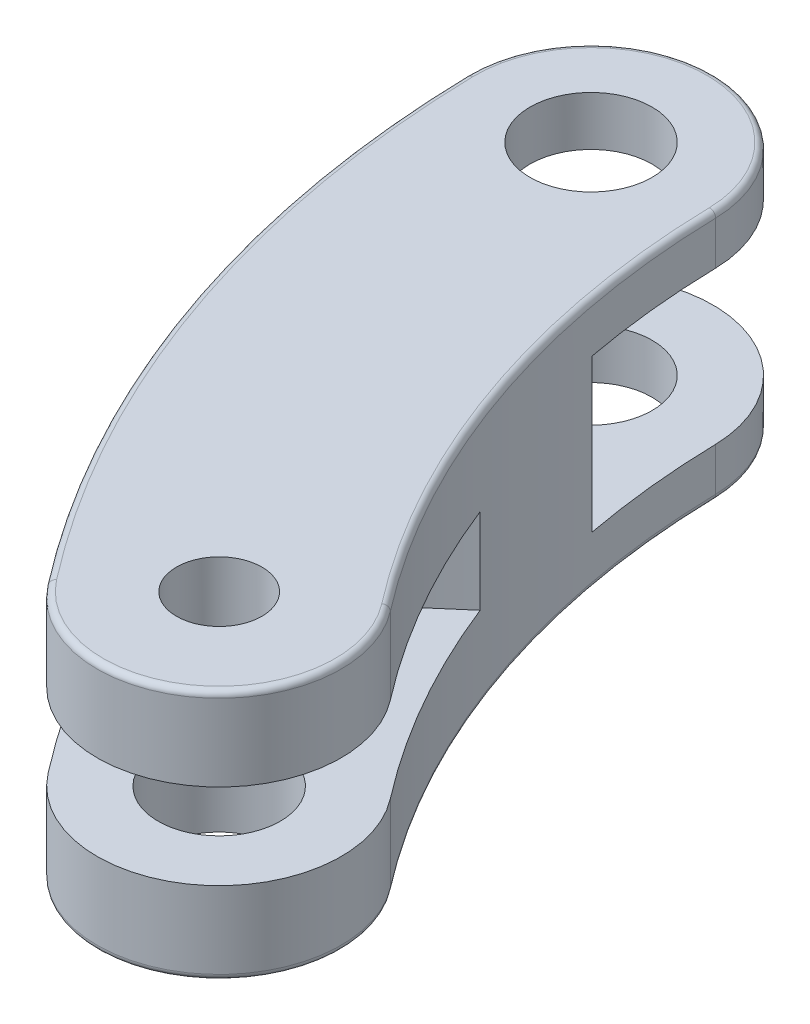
ISO-10303-21;
HEADER;
FILE_DESCRIPTION(('STEP AP214'),'2;1');
FILE_NAME('part.step','',(''),(''),'','','');
FILE_SCHEMA(('AUTOMOTIVE_DESIGN { 1 0 10303 214 1 1 1 1 }'));
ENDSEC;
DATA;
#1=APPLICATION_CONTEXT('core data for automotive mechanical design processes');
#2=APPLICATION_PROTOCOL_DEFINITION('international standard','automotive_design',2000,#1);
#3=PRODUCT_CONTEXT('',#1,'mechanical');
#4=PRODUCT('Part','Part','',(#3));
#5=PRODUCT_RELATED_PRODUCT_CATEGORY('part','',(#4));
#6=PRODUCT_DEFINITION_FORMATION('','',#4);
#7=PRODUCT_DEFINITION_CONTEXT('part definition',#1,'design');
#8=PRODUCT_DEFINITION('design','',#6,#7);
#9=PRODUCT_DEFINITION_SHAPE('','',#8);
#10=(LENGTH_UNIT() NAMED_UNIT(*) SI_UNIT(.MILLI.,.METRE.));
#11=(NAMED_UNIT(*) PLANE_ANGLE_UNIT() SI_UNIT($,.RADIAN.));
#12=(NAMED_UNIT(*) SI_UNIT($,.STERADIAN.) SOLID_ANGLE_UNIT());
#13=UNCERTAINTY_MEASURE_WITH_UNIT(LENGTH_MEASURE(1.E-05),#10,'distance_accuracy_value','');
#14=(GEOMETRIC_REPRESENTATION_CONTEXT(3) GLOBAL_UNCERTAINTY_ASSIGNED_CONTEXT((#13)) GLOBAL_UNIT_ASSIGNED_CONTEXT((#10,
#11,#12)) REPRESENTATION_CONTEXT('',''));
#15=CARTESIAN_POINT('',(0.,0.,0.));
#16=DIRECTION('',(0.,0.,1.));
#17=DIRECTION('',(1.,0.,0.));
#18=AXIS2_PLACEMENT_3D('',#15,#16,#17);
#19=CARTESIAN_POINT('',(2160.44964708,591.734442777,716.131939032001));
#20=DIRECTION('',(0.,1.,0.));
#21=DIRECTION('',(0.,0.,1.));
#22=AXIS2_PLACEMENT_3D('',#19,#20,#21);
#23=CYLINDRICAL_SURFACE('',#22,10.0000000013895);
#24=DIRECTION('',(0.,1.,0.));
#25=VECTOR('',#24,1.);
#26=CARTESIAN_POINT('',(2168.36413867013,591.734442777,710.019589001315));
#27=LINE('',#26,#25);
#28=CARTESIAN_POINT('',(2168.36413867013,605.534442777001,710.019589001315));
#29=VERTEX_POINT('',#28);
#30=CARTESIAN_POINT('',(2168.36413867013,611.833591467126,710.019589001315));
#31=VERTEX_POINT('',#30);
#32=EDGE_CURVE('E196',#29,#31,#27,.T.);
#33=ORIENTED_EDGE('',*,*,#32,.T.);
#34=CARTESIAN_POINT('',(2160.44964708,611.833591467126,716.131939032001));
#35=DIRECTION('',(0.,-1.,0.));
#36=DIRECTION('',(0.,0.,-1.));
#37=AXIS2_PLACEMENT_3D('',#34,#35,#36);
#38=CIRCLE('',#37,10.0000000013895);
#39=CARTESIAN_POINT('',(2152.535155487,611.833591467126,722.244289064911));
#40=VERTEX_POINT('',#39);
#41=EDGE_CURVE('E232',#31,#40,#38,.T.);
#42=ORIENTED_EDGE('',*,*,#41,.T.);
#43=DIRECTION('',(0.,1.,0.));
#44=VECTOR('',#43,1.);
#45=CARTESIAN_POINT('',(2152.535155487,591.734442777,722.244289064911));
#46=LINE('',#45,#44);
#47=CARTESIAN_POINT('',(2152.535155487,605.534442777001,722.244289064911));
#48=VERTEX_POINT('',#47);
#49=EDGE_CURVE('E199',#48,#40,#46,.T.);
#50=ORIENTED_EDGE('',*,*,#49,.F.);
#51=CARTESIAN_POINT('',(2160.44964708,605.534442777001,716.131939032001));
#52=DIRECTION('',(0.,1.,0.));
#53=DIRECTION('',(0.,0.,1.));
#54=AXIS2_PLACEMENT_3D('',#51,#52,#53);
#55=CIRCLE('',#54,10.0000000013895);
#56=EDGE_CURVE('E155',#29,#48,#55,.F.);
#57=ORIENTED_EDGE('',*,*,#56,.F.);
#58=EDGE_LOOP('',(#33,#42,#50,#57));
#59=FACE_BOUND('',#58,.T.);
#60=ADVANCED_FACE('F33',(#59),#23,.T.);
#61=CARTESIAN_POINT('',(2143.78489095,591.734442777,668.990811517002));
#62=DIRECTION('',(0.,1.,0.));
#63=DIRECTION('',(0.,0.,1.));
#64=AXIS2_PLACEMENT_3D('',#61,#62,#63);
#65=CYLINDRICAL_SURFACE('',#64,10.0000000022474);
#66=DIRECTION('',(0.,1.,0.));
#67=VECTOR('',#66,1.);
#68=CARTESIAN_POINT('',(2133.78730484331,591.734442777,669.210520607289));
#69=LINE('',#68,#67);
#70=CARTESIAN_POINT('',(2133.78730484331,608.284442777,669.210520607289));
#71=VERTEX_POINT('',#70);
#72=CARTESIAN_POINT('',(2133.78730484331,611.833591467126,669.210520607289));
#73=VERTEX_POINT('',#72);
#74=EDGE_CURVE('E202',#71,#73,#69,.T.);
#75=ORIENTED_EDGE('',*,*,#74,.T.);
#76=CARTESIAN_POINT('',(2143.78489095,611.833591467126,668.990811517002));
#77=DIRECTION('',(0.,-1.,0.));
#78=DIRECTION('',(0.,0.,-1.));
#79=AXIS2_PLACEMENT_3D('',#76,#77,#78);
#80=CIRCLE('',#79,10.0000000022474);
#81=CARTESIAN_POINT('',(2153.78247705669,611.833591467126,668.771102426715));
#82=VERTEX_POINT('',#81);
#83=EDGE_CURVE('E225',#73,#82,#80,.T.);
#84=ORIENTED_EDGE('',*,*,#83,.T.);
#85=DIRECTION('',(0.,1.,0.));
#86=VECTOR('',#85,1.);
#87=CARTESIAN_POINT('',(2153.78247705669,591.734442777,668.771102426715));
#88=LINE('',#87,#86);
#89=CARTESIAN_POINT('',(2153.78247705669,608.284442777,668.771102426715));
#90=VERTEX_POINT('',#89);
#91=EDGE_CURVE('E192',#90,#82,#88,.T.);
#92=ORIENTED_EDGE('',*,*,#91,.F.);
#93=CARTESIAN_POINT('',(2143.78489095,608.284442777,668.990811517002));
#94=DIRECTION('',(0.,1.,0.));
#95=DIRECTION('',(0.,0.,1.));
#96=AXIS2_PLACEMENT_3D('',#93,#94,#95);
#97=CIRCLE('',#96,10.0000000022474);
#98=EDGE_CURVE('E207',#71,#90,#97,.F.);
#99=ORIENTED_EDGE('',*,*,#98,.F.);
#100=EDGE_LOOP('',(#75,#84,#92,#99));
#101=FACE_BOUND('',#100,.T.);
#102=ADVANCED_FACE('F347',(#101),#65,.T.);
#103=CARTESIAN_POINT('',(2223.76557979,591.734442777,667.233138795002));
#104=DIRECTION('',(0.,1.,0.));
#105=DIRECTION('',(0.,0.,1.));
#106=AXIS2_PLACEMENT_3D('',#103,#104,#105);
#107=CYLINDRICAL_SURFACE('',#106,69.9999999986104);
#108=CARTESIAN_POINT('',(2168.36413867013,592.235398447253,710.019589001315));
#109=VERTEX_POINT('',#108);
#110=CARTESIAN_POINT('',(2168.36413867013,598.534442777,710.019589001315));
#111=VERTEX_POINT('',#110);
#112=EDGE_CURVE('E193',#109,#111,#27,.T.);
#113=ORIENTED_EDGE('',*,*,#112,.F.);
#114=CARTESIAN_POINT('',(2223.76557979,592.235398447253,667.233138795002));
#115=DIRECTION('',(0.,-1.,0.));
#116=DIRECTION('',(0.,0.,-1.));
#117=AXIS2_PLACEMENT_3D('',#114,#115,#116);
#118=CIRCLE('',#117,69.9999999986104);
#119=CARTESIAN_POINT('',(2153.78247705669,592.235398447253,668.771102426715));
#120=VERTEX_POINT('',#119);
#121=EDGE_CURVE('E234',#109,#120,#118,.T.);
#122=ORIENTED_EDGE('',*,*,#121,.T.);
#123=CARTESIAN_POINT('',(2153.78247705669,595.784442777,668.771102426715));
#124=VERTEX_POINT('',#123);
#125=EDGE_CURVE('E203',#120,#124,#88,.T.);
#126=ORIENTED_EDGE('',*,*,#125,.T.);
#127=CARTESIAN_POINT('',(2223.76557979,595.784442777,667.233138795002));
#128=DIRECTION('',(0.,-1.,0.));
#129=DIRECTION('',(0.,0.,-1.));
#130=AXIS2_PLACEMENT_3D('',#127,#128,#129);
#131=CIRCLE('',#130,69.9999999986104);
#132=CARTESIAN_POINT('',(2154.95172259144,595.784442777,680.064859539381));
#133=VERTEX_POINT('',#132);
#134=EDGE_CURVE('E183',#133,#124,#131,.T.);
#135=ORIENTED_EDGE('',*,*,#134,.F.);
#136=DIRECTION('',(0.,1.,0.));
#137=VECTOR('',#136,1.);
#138=CARTESIAN_POINT('',(2154.95172259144,602.034442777,680.064859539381));
#139=LINE('',#138,#137);
#140=CARTESIAN_POINT('',(2154.95172259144,608.284442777,680.064859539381));
#141=VERTEX_POINT('',#140);
#142=EDGE_CURVE('E190',#141,#133,#139,.F.);
#143=ORIENTED_EDGE('',*,*,#142,.F.);
#144=CARTESIAN_POINT('',(2223.76557979,608.284442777,667.233138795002));
#145=DIRECTION('',(0.,1.,0.));
#146=DIRECTION('',(0.,0.,1.));
#147=AXIS2_PLACEMENT_3D('',#144,#145,#146);
#148=CIRCLE('',#147,69.9999999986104);
#149=EDGE_CURVE('E188',#90,#141,#148,.T.);
#150=ORIENTED_EDGE('',*,*,#149,.F.);
#151=ORIENTED_EDGE('',*,*,#91,.T.);
#152=CARTESIAN_POINT('',(2223.76557979,611.833591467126,667.233138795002));
#153=DIRECTION('',(0.,-1.,0.));
#154=DIRECTION('',(0.,0.,-1.));
#155=AXIS2_PLACEMENT_3D('',#152,#153,#154);
#156=CIRCLE('',#155,69.9999999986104);
#157=EDGE_CURVE('E230',#82,#31,#156,.F.);
#158=ORIENTED_EDGE('',*,*,#157,.T.);
#159=ORIENTED_EDGE('',*,*,#32,.F.);
#160=CARTESIAN_POINT('',(2223.76557979,605.534442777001,667.233138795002));
#161=DIRECTION('',(0.,1.,0.));
#162=DIRECTION('',(0.,0.,1.));
#163=AXIS2_PLACEMENT_3D('',#160,#161,#162);
#164=CIRCLE('',#163,69.9999999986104);
#165=CARTESIAN_POINT('',(2158.66503431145,605.534442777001,692.960924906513));
#166=VERTEX_POINT('',#165);
#167=EDGE_CURVE('E170',#166,#29,#164,.T.);
#168=ORIENTED_EDGE('',*,*,#167,.F.);
#169=DIRECTION('',(0.,1.,0.));
#170=VECTOR('',#169,1.);
#171=CARTESIAN_POINT('',(2158.66503431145,602.034442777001,692.960924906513));
#172=LINE('',#171,#170);
#173=CARTESIAN_POINT('',(2158.66503431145,598.534442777,692.960924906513));
#174=VERTEX_POINT('',#173);
#175=EDGE_CURVE('E160',#174,#166,#172,.T.);
#176=ORIENTED_EDGE('',*,*,#175,.F.);
#177=CARTESIAN_POINT('',(2223.76557979,598.534442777,667.233138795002));
#178=DIRECTION('',(0.,-1.,0.));
#179=DIRECTION('',(0.,0.,-1.));
#180=AXIS2_PLACEMENT_3D('',#177,#178,#179);
#181=CIRCLE('',#180,69.9999999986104);
#182=EDGE_CURVE('E144',#111,#174,#181,.T.);
#183=ORIENTED_EDGE('',*,*,#182,.F.);
#184=EDGE_LOOP('',(#113,#122,#126,#135,#143,#150,#151,#158,#159,#168,#176,#183));
#185=FACE_BOUND('',#184,.T.);
#186=ADVANCED_FACE('F35',(#185),#107,.F.);
#187=CARTESIAN_POINT('',(2152.535155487,592.235398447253,722.244289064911));
#188=VERTEX_POINT('',#187);
#189=CARTESIAN_POINT('',(2152.535155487,598.534442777,722.244289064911));
#190=VERTEX_POINT('',#189);
#191=EDGE_CURVE('E197',#188,#190,#46,.T.);
#192=ORIENTED_EDGE('',*,*,#191,.F.);
#193=CARTESIAN_POINT('',(2160.44964708,592.235398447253,716.131939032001));
#194=DIRECTION('',(0.,-1.,0.));
#195=DIRECTION('',(0.,0.,-1.));
#196=AXIS2_PLACEMENT_3D('',#193,#194,#195);
#197=CIRCLE('',#196,10.0000000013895);
#198=EDGE_CURVE('E246',#188,#109,#197,.F.);
#199=ORIENTED_EDGE('',*,*,#198,.T.);
#200=ORIENTED_EDGE('',*,*,#112,.T.);
#201=CARTESIAN_POINT('',(2160.44964708,598.534442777,716.131939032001));
#202=DIRECTION('',(0.,-1.,0.));
#203=DIRECTION('',(0.,0.,-1.));
#204=AXIS2_PLACEMENT_3D('',#201,#202,#203);
#205=CIRCLE('',#204,10.0000000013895);
#206=EDGE_CURVE('E151',#190,#111,#205,.F.);
#207=ORIENTED_EDGE('',*,*,#206,.F.);
#208=EDGE_LOOP('',(#192,#199,#200,#207));
#209=FACE_BOUND('',#208,.T.);
#210=ADVANCED_FACE('F249',(#209),#23,.T.);
#211=CARTESIAN_POINT('',(2223.76557979,591.734442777,667.233138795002));
#212=DIRECTION('',(0.,1.,0.));
#213=DIRECTION('',(0.,0.,1.));
#214=AXIS2_PLACEMENT_3D('',#211,#212,#213);
#215=CYLINDRICAL_SURFACE('',#214,90.0000000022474);
#216=CARTESIAN_POINT('',(2133.78730484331,592.235398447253,669.210520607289));
#217=VERTEX_POINT('',#216);
#218=CARTESIAN_POINT('',(2133.78730484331,595.784442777,669.210520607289));
#219=VERTEX_POINT('',#218);
#220=EDGE_CURVE('E200',#217,#219,#69,.T.);
#221=ORIENTED_EDGE('',*,*,#220,.F.);
#222=CARTESIAN_POINT('',(2223.76557979,592.235398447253,667.233138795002));
#223=DIRECTION('',(0.,-1.,0.));
#224=DIRECTION('',(0.,0.,-1.));
#225=AXIS2_PLACEMENT_3D('',#222,#223,#224);
#226=CIRCLE('',#225,90.0000000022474);
#227=EDGE_CURVE('E11',#217,#188,#226,.F.);
#228=ORIENTED_EDGE('',*,*,#227,.T.);
#229=ORIENTED_EDGE('',*,*,#191,.T.);
#230=CARTESIAN_POINT('',(2223.76557979,598.534442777,667.233138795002));
#231=DIRECTION('',(0.,-1.,0.));
#232=DIRECTION('',(0.,0.,-1.));
#233=AXIS2_PLACEMENT_3D('',#230,#231,#232);
#234=CIRCLE('',#233,90.0000000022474);
#235=CARTESIAN_POINT('',(2143.99607730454,598.534442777,708.90838892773));
#236=VERTEX_POINT('',#235);
#237=EDGE_CURVE('E211',#236,#190,#234,.F.);
#238=ORIENTED_EDGE('',*,*,#237,.F.);
#239=DIRECTION('',(0.,1.,0.));
#240=VECTOR('',#239,1.);
#241=CARTESIAN_POINT('',(2143.99607730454,602.034442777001,708.90838892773));
#242=LINE('',#241,#240);
#243=CARTESIAN_POINT('',(2143.99607730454,605.534442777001,708.908388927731));
#244=VERTEX_POINT('',#243);
#245=EDGE_CURVE('E163',#244,#236,#242,.F.);
#246=ORIENTED_EDGE('',*,*,#245,.F.);
#247=CARTESIAN_POINT('',(2223.76557979,605.534442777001,667.233138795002));
#248=DIRECTION('',(0.,1.,0.));
#249=DIRECTION('',(0.,0.,1.));
#250=AXIS2_PLACEMENT_3D('',#247,#248,#249);
#251=CIRCLE('',#250,90.0000000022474);
#252=EDGE_CURVE('E214',#48,#244,#251,.F.);
#253=ORIENTED_EDGE('',*,*,#252,.F.);
#254=ORIENTED_EDGE('',*,*,#49,.T.);
#255=CARTESIAN_POINT('',(2223.76557979,611.833591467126,667.233138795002));
#256=DIRECTION('',(0.,-1.,0.));
#257=DIRECTION('',(0.,0.,-1.));
#258=AXIS2_PLACEMENT_3D('',#255,#256,#257);
#259=CIRCLE('',#258,90.0000000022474);
#260=EDGE_CURVE('E228',#40,#73,#259,.T.);
#261=ORIENTED_EDGE('',*,*,#260,.T.);
#262=ORIENTED_EDGE('',*,*,#74,.F.);
#263=CARTESIAN_POINT('',(2223.76557979,608.284442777,667.233138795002));
#264=DIRECTION('',(0.,1.,0.));
#265=DIRECTION('',(0.,0.,1.));
#266=AXIS2_PLACEMENT_3D('',#263,#264,#265);
#267=CIRCLE('',#266,90.0000000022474);
#268=CARTESIAN_POINT('',(2135.40094688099,608.284442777,684.31212152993));
#269=VERTEX_POINT('',#268);
#270=EDGE_CURVE('E186',#269,#71,#267,.F.);
#271=ORIENTED_EDGE('',*,*,#270,.F.);
#272=DIRECTION('',(0.,1.,0.));
#273=VECTOR('',#272,1.);
#274=CARTESIAN_POINT('',(2135.40094688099,602.034442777,684.31212152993));
#275=LINE('',#274,#273);
#276=CARTESIAN_POINT('',(2135.40094688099,595.784442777,684.31212152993));
#277=VERTEX_POINT('',#276);
#278=EDGE_CURVE('E209',#277,#269,#275,.T.);
#279=ORIENTED_EDGE('',*,*,#278,.F.);
#280=CARTESIAN_POINT('',(2223.76557979,595.784442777,667.233138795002));
#281=DIRECTION('',(0.,-1.,0.));
#282=DIRECTION('',(0.,0.,-1.));
#283=AXIS2_PLACEMENT_3D('',#280,#281,#282);
#284=CIRCLE('',#283,90.0000000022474);
#285=EDGE_CURVE('E181',#219,#277,#284,.F.);
#286=ORIENTED_EDGE('',*,*,#285,.F.);
#287=EDGE_LOOP('',(#221,#228,#229,#238,#246,#253,#254,#261,#262,#271,#279,#286));
#288=FACE_BOUND('',#287,.T.);
#289=ADVANCED_FACE('F320',(#288),#215,.T.);
#290=ORIENTED_EDGE('',*,*,#125,.F.);
#291=CARTESIAN_POINT('',(2143.78489095,592.235398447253,668.990811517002));
#292=DIRECTION('',(0.,-1.,0.));
#293=DIRECTION('',(0.,0.,-1.));
#294=AXIS2_PLACEMENT_3D('',#291,#292,#293);
#295=CIRCLE('',#294,10.0000000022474);
#296=EDGE_CURVE('E41',#120,#217,#295,.F.);
#297=ORIENTED_EDGE('',*,*,#296,.T.);
#298=ORIENTED_EDGE('',*,*,#220,.T.);
#299=CARTESIAN_POINT('',(2143.78489095,595.784442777,668.990811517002));
#300=DIRECTION('',(0.,-1.,0.));
#301=DIRECTION('',(0.,0.,-1.));
#302=AXIS2_PLACEMENT_3D('',#299,#300,#301);
#303=CIRCLE('',#302,10.0000000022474);
#304=EDGE_CURVE('E195',#124,#219,#303,.F.);
#305=ORIENTED_EDGE('',*,*,#304,.F.);
#306=EDGE_LOOP('',(#290,#297,#298,#305));
#307=FACE_BOUND('',#306,.T.);
#308=ADVANCED_FACE('F366',(#307),#65,.T.);
#309=CARTESIAN_POINT('',(2183.77523537,591.734442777,668.111975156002));
#310=DIRECTION('',(0.,-1.,0.));
#311=DIRECTION('',(0.,0.,-1.));
#312=AXIS2_PLACEMENT_3D('',#309,#310,#311);
#313=PLANE('',#312);
#314=CARTESIAN_POINT('',(2143.78489095,591.734442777,668.990811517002));
#315=DIRECTION('',(0.,-1.,0.));
#316=DIRECTION('',(0.,0.,-1.));
#317=AXIS2_PLACEMENT_3D('',#314,#315,#316);
#318=CIRCLE('',#317,9.49904433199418);
#319=CARTESIAN_POINT('',(2134.28813959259,591.734442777,669.199514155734));
#320=VERTEX_POINT('',#319);
#321=CARTESIAN_POINT('',(2153.2816423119,591.734442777,668.782108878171));
#322=VERTEX_POINT('',#321);
#323=EDGE_CURVE('E239',#320,#322,#318,.T.);
#324=ORIENTED_EDGE('',*,*,#323,.T.);
#325=CARTESIAN_POINT('',(2223.76557979,591.734442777,667.233138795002));
#326=DIRECTION('',(0.,-1.,0.));
#327=DIRECTION('',(0.,0.,-1.));
#328=AXIS2_PLACEMENT_3D('',#325,#326,#327);
#329=CIRCLE('',#328,70.5009556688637);
#330=CARTESIAN_POINT('',(2167.96765772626,591.734442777,710.325790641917));
#331=VERTEX_POINT('',#330);
#332=EDGE_CURVE('E243',#322,#331,#329,.F.);
#333=ORIENTED_EDGE('',*,*,#332,.T.);
#334=CARTESIAN_POINT('',(2160.44964708,591.734442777,716.131939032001));
#335=DIRECTION('',(0.,-1.,0.));
#336=DIRECTION('',(0.,0.,-1.));
#337=AXIS2_PLACEMENT_3D('',#334,#335,#336);
#338=CIRCLE('',#337,9.49904433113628);
#339=CARTESIAN_POINT('',(2152.93163643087,591.734442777,721.938087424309));
#340=VERTEX_POINT('',#339);
#341=EDGE_CURVE('E241',#331,#340,#338,.T.);
#342=ORIENTED_EDGE('',*,*,#341,.T.);
#343=CARTESIAN_POINT('',(2223.76557979,591.734442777,667.233138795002));
#344=DIRECTION('',(0.,-1.,0.));
#345=DIRECTION('',(0.,0.,-1.));
#346=AXIS2_PLACEMENT_3D('',#343,#344,#345);
#347=CIRCLE('',#346,89.4990443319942);
#348=EDGE_CURVE('E237',#340,#320,#347,.T.);
#349=ORIENTED_EDGE('',*,*,#348,.T.);
#350=EDGE_LOOP('',(#324,#333,#342,#349));
#351=FACE_BOUND('',#350,.T.);
#352=CARTESIAN_POINT('',(2143.78489095,591.734442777,668.990811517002));
#353=DIRECTION('',(0.,-1.,0.));
#354=DIRECTION('',(0.,0.,1.));
#355=AXIS2_PLACEMENT_3D('',#352,#353,#354);
#356=CIRCLE('',#355,5.);
#357=CARTESIAN_POINT('',(2143.78489095,591.734442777,673.990811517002));
#358=VERTEX_POINT('',#357);
#359=EDGE_CURVE('E287',#358,#358,#356,.T.);
#360=ORIENTED_EDGE('',*,*,#359,.F.);
#361=EDGE_LOOP('',(#360));
#362=FACE_BOUND('',#361,.T.);
#363=CARTESIAN_POINT('',(2160.44964708,591.734442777,716.131939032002));
#364=DIRECTION('',(0.,-1.,0.));
#365=DIRECTION('',(0.,0.,1.));
#366=AXIS2_PLACEMENT_3D('',#363,#364,#365);
#367=CIRCLE('',#366,5.);
#368=CARTESIAN_POINT('',(2160.44964708,591.734442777,721.131939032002));
#369=VERTEX_POINT('',#368);
#370=EDGE_CURVE('E293',#369,#369,#367,.T.);
#371=ORIENTED_EDGE('',*,*,#370,.F.);
#372=EDGE_LOOP('',(#371));
#373=FACE_BOUND('',#372,.T.);
#374=ADVANCED_FACE('F543',(#351,#362,#373),#313,.T.);
#375=CARTESIAN_POINT('',(2183.77523537,612.334442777,668.111975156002));
#376=DIRECTION('',(0.,-1.,0.));
#377=DIRECTION('',(0.,0.,-1.));
#378=AXIS2_PLACEMENT_3D('',#375,#376,#377);
#379=PLANE('',#378);
#380=CARTESIAN_POINT('',(2223.76557979,612.334442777,667.233138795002));
#381=DIRECTION('',(0.,-1.,0.));
#382=DIRECTION('',(0.,0.,-1.));
#383=AXIS2_PLACEMENT_3D('',#380,#381,#382);
#384=CIRCLE('',#383,70.5008513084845);
#385=CARTESIAN_POINT('',(2167.96774032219,612.334442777,710.3257268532));
#386=VERTEX_POINT('',#385);
#387=CARTESIAN_POINT('',(2153.28174665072,612.334442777,668.782106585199));
#388=VERTEX_POINT('',#387);
#389=EDGE_CURVE('E218',#386,#388,#384,.T.);
#390=ORIENTED_EDGE('',*,*,#389,.T.);
#391=CARTESIAN_POINT('',(2143.78489095,612.334442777,668.990811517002));
#392=DIRECTION('',(0.,-1.,0.));
#393=DIRECTION('',(0.,0.,-1.));
#394=AXIS2_PLACEMENT_3D('',#391,#392,#393);
#395=CIRCLE('',#394,9.49914869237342);
#396=CARTESIAN_POINT('',(2134.28803525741,612.334442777,669.199516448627));
#397=VERTEX_POINT('',#396);
#398=EDGE_CURVE('E222',#388,#397,#395,.F.);
#399=ORIENTED_EDGE('',*,*,#398,.T.);
#400=CARTESIAN_POINT('',(2223.76557979,612.334442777,667.233138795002));
#401=DIRECTION('',(0.,-1.,0.));
#402=DIRECTION('',(0.,0.,-1.));
#403=AXIS2_PLACEMENT_3D('',#400,#401,#402);
#404=CIRCLE('',#403,89.4991486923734);
#405=CARTESIAN_POINT('',(2152.93155383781,612.334442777,721.938151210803));
#406=VERTEX_POINT('',#405);
#407=EDGE_CURVE('E220',#397,#406,#404,.F.);
#408=ORIENTED_EDGE('',*,*,#407,.T.);
#409=CARTESIAN_POINT('',(2160.44964708,612.334442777,716.131939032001));
#410=DIRECTION('',(0.,-1.,0.));
#411=DIRECTION('',(0.,0.,-1.));
#412=AXIS2_PLACEMENT_3D('',#409,#410,#411);
#413=CIRCLE('',#412,9.49914869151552);
#414=EDGE_CURVE('E216',#406,#386,#413,.F.);
#415=ORIENTED_EDGE('',*,*,#414,.T.);
#416=EDGE_LOOP('',(#390,#399,#408,#415));
#417=FACE_BOUND('',#416,.T.);
#418=CARTESIAN_POINT('',(2143.78489095,612.334442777,668.990811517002));
#419=DIRECTION('',(0.,-1.,0.));
#420=DIRECTION('',(0.,0.,-1.));
#421=AXIS2_PLACEMENT_3D('',#418,#419,#420);
#422=CIRCLE('',#421,5.);
#423=CARTESIAN_POINT('',(2143.78489095,612.334442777,663.990811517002));
#424=VERTEX_POINT('',#423);
#425=EDGE_CURVE('E303',#424,#424,#422,.F.);
#426=ORIENTED_EDGE('',*,*,#425,.F.);
#427=EDGE_LOOP('',(#426));
#428=FACE_BOUND('',#427,.T.);
#429=CARTESIAN_POINT('',(2160.44964708,612.334442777,716.131939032));
#430=DIRECTION('',(0.,1.,0.));
#431=DIRECTION('',(0.,0.,-1.));
#432=AXIS2_PLACEMENT_3D('',#429,#430,#431);
#433=CIRCLE('',#432,3.49999999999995);
#434=CARTESIAN_POINT('',(2160.44964708,612.334442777,712.631939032));
#435=VERTEX_POINT('',#434);
#436=EDGE_CURVE('E306',#435,#435,#433,.T.);
#437=ORIENTED_EDGE('',*,*,#436,.F.);
#438=EDGE_LOOP('',(#437));
#439=FACE_BOUND('',#438,.T.);
#440=ADVANCED_FACE('F335',(#417,#428,#439),#379,.F.);
#441=CARTESIAN_POINT('',(2128.32635665,595.784442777,604.625546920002));
#442=DIRECTION('',(0.,1.,0.));
#443=DIRECTION('',(0.,0.,1.));
#444=AXIS2_PLACEMENT_3D('',#441,#442,#443);
#445=CYLINDRICAL_SURFACE('',#444,80.0000000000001);
#446=ORIENTED_EDGE('',*,*,#142,.T.);
#447=CARTESIAN_POINT('',(2128.32635665,595.784442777,604.625546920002));
#448=DIRECTION('',(0.,1.,0.));
#449=DIRECTION('',(0.,0.,1.));
#450=AXIS2_PLACEMENT_3D('',#447,#448,#449);
#451=CIRCLE('',#450,80.);
#452=EDGE_CURVE('E171',#277,#133,#451,.T.);
#453=ORIENTED_EDGE('',*,*,#452,.F.);
#454=ORIENTED_EDGE('',*,*,#278,.T.);
#455=CARTESIAN_POINT('',(2128.32635665,608.284442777,604.625546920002));
#456=DIRECTION('',(0.,1.,0.));
#457=DIRECTION('',(0.,0.,1.));
#458=AXIS2_PLACEMENT_3D('',#455,#456,#457);
#459=CIRCLE('',#458,80.0000000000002);
#460=EDGE_CURVE('E174',#269,#141,#459,.T.);
#461=ORIENTED_EDGE('',*,*,#460,.T.);
#462=EDGE_LOOP('',(#446,#453,#454,#461));
#463=FACE_BOUND('',#462,.T.);
#464=ADVANCED_FACE('F530',(#463),#445,.F.);
#465=CARTESIAN_POINT('',(2128.32635665,608.284442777,604.625546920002));
#466=DIRECTION('',(0.,1.,0.));
#467=DIRECTION('',(0.,0.,1.));
#468=AXIS2_PLACEMENT_3D('',#465,#466,#467);
#469=PLANE('',#468);
#470=CARTESIAN_POINT('',(2143.78489095,608.284442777,668.990811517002));
#471=DIRECTION('',(0.,-1.,0.));
#472=DIRECTION('',(0.,0.,1.));
#473=AXIS2_PLACEMENT_3D('',#470,#471,#472);
#474=CIRCLE('',#473,5.);
#475=CARTESIAN_POINT('',(2143.78489095,608.284442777,673.990811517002));
#476=VERTEX_POINT('',#475);
#477=EDGE_CURVE('E300',#476,#476,#474,.T.);
#478=ORIENTED_EDGE('',*,*,#477,.F.);
#479=EDGE_LOOP('',(#478));
#480=FACE_BOUND('',#479,.T.);
#481=ORIENTED_EDGE('',*,*,#149,.T.);
#482=ORIENTED_EDGE('',*,*,#460,.F.);
#483=ORIENTED_EDGE('',*,*,#270,.T.);
#484=ORIENTED_EDGE('',*,*,#98,.T.);
#485=EDGE_LOOP('',(#481,#482,#483,#484));
#486=FACE_BOUND('',#485,.T.);
#487=ADVANCED_FACE('F523',(#480,#486),#469,.F.);
#488=CARTESIAN_POINT('',(2154.95172259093,595.784442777,680.064859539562));
#489=DIRECTION('',(0.,-1.,0.));
#490=DIRECTION('',(0.,0.,-1.));
#491=AXIS2_PLACEMENT_3D('',#488,#489,#490);
#492=PLANE('',#491);
#493=CARTESIAN_POINT('',(2143.78489095,595.784442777,668.990811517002));
#494=DIRECTION('',(0.,-1.,0.));
#495=DIRECTION('',(0.,0.,-1.));
#496=AXIS2_PLACEMENT_3D('',#493,#494,#495);
#497=CIRCLE('',#496,5.);
#498=CARTESIAN_POINT('',(2143.78489095,595.784442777,663.990811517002));
#499=VERTEX_POINT('',#498);
#500=EDGE_CURVE('E290',#499,#499,#497,.F.);
#501=ORIENTED_EDGE('',*,*,#500,.F.);
#502=EDGE_LOOP('',(#501));
#503=FACE_BOUND('',#502,.T.);
#504=ORIENTED_EDGE('',*,*,#134,.T.);
#505=ORIENTED_EDGE('',*,*,#304,.T.);
#506=ORIENTED_EDGE('',*,*,#285,.T.);
#507=ORIENTED_EDGE('',*,*,#452,.T.);
#508=EDGE_LOOP('',(#504,#505,#506,#507));
#509=FACE_BOUND('',#508,.T.);
#510=ADVANCED_FACE('F392',(#503,#509),#492,.F.);
#511=CARTESIAN_POINT('',(2209.66760327,598.534442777,754.594827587));
#512=DIRECTION('',(0.,1.,0.));
#513=DIRECTION('',(0.,0.,1.));
#514=AXIS2_PLACEMENT_3D('',#511,#512,#513);
#515=CYLINDRICAL_SURFACE('',#514,79.9999999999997);
#516=ORIENTED_EDGE('',*,*,#175,.T.);
#517=CARTESIAN_POINT('',(2209.66760327,605.534442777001,754.594827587));
#518=DIRECTION('',(0.,1.,0.));
#519=DIRECTION('',(0.,0.,1.));
#520=AXIS2_PLACEMENT_3D('',#517,#518,#519);
#521=CIRCLE('',#520,79.9999999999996);
#522=EDGE_CURVE('E165',#166,#244,#521,.T.);
#523=ORIENTED_EDGE('',*,*,#522,.T.);
#524=ORIENTED_EDGE('',*,*,#245,.T.);
#525=CARTESIAN_POINT('',(2209.66760327,598.534442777,754.594827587));
#526=DIRECTION('',(0.,1.,0.));
#527=DIRECTION('',(0.,0.,1.));
#528=AXIS2_PLACEMENT_3D('',#525,#526,#527);
#529=CIRCLE('',#528,79.9999999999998);
#530=EDGE_CURVE('E148',#174,#236,#529,.T.);
#531=ORIENTED_EDGE('',*,*,#530,.F.);
#532=EDGE_LOOP('',(#516,#523,#524,#531));
#533=FACE_BOUND('',#532,.T.);
#534=ADVANCED_FACE('F158',(#533),#515,.F.);
#535=CARTESIAN_POINT('',(2209.66760327,605.534442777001,754.594827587));
#536=DIRECTION('',(0.,1.,0.));
#537=DIRECTION('',(0.,0.,1.));
#538=AXIS2_PLACEMENT_3D('',#535,#536,#537);
#539=PLANE('',#538);
#540=CARTESIAN_POINT('',(2160.44964708,605.534442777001,716.131939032));
#541=DIRECTION('',(0.,1.,0.));
#542=DIRECTION('',(0.,0.,1.));
#543=AXIS2_PLACEMENT_3D('',#540,#541,#542);
#544=CIRCLE('',#543,3.49999999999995);
#545=CARTESIAN_POINT('',(2160.44964708,605.534442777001,719.631939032));
#546=VERTEX_POINT('',#545);
#547=EDGE_CURVE('E166',#546,#546,#544,.F.);
#548=ORIENTED_EDGE('',*,*,#547,.F.);
#549=EDGE_LOOP('',(#548));
#550=FACE_BOUND('',#549,.T.);
#551=ORIENTED_EDGE('',*,*,#167,.T.);
#552=ORIENTED_EDGE('',*,*,#56,.T.);
#553=ORIENTED_EDGE('',*,*,#252,.T.);
#554=ORIENTED_EDGE('',*,*,#522,.F.);
#555=EDGE_LOOP('',(#551,#552,#553,#554));
#556=FACE_BOUND('',#555,.T.);
#557=ADVANCED_FACE('F315',(#550,#556),#539,.F.);
#558=CARTESIAN_POINT('',(2143.99607730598,598.534442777,708.90838892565));
#559=DIRECTION('',(0.,-1.,0.));
#560=DIRECTION('',(0.,0.,-1.));
#561=AXIS2_PLACEMENT_3D('',#558,#559,#560);
#562=PLANE('',#561);
#563=CARTESIAN_POINT('',(2160.44964708,598.534442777,716.131939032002));
#564=DIRECTION('',(0.,-1.,0.));
#565=DIRECTION('',(0.,0.,-1.));
#566=AXIS2_PLACEMENT_3D('',#563,#564,#565);
#567=CIRCLE('',#566,5.);
#568=CARTESIAN_POINT('',(2160.44964708,598.534442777,711.131939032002));
#569=VERTEX_POINT('',#568);
#570=EDGE_CURVE('E296',#569,#569,#567,.F.);
#571=ORIENTED_EDGE('',*,*,#570,.F.);
#572=EDGE_LOOP('',(#571));
#573=FACE_BOUND('',#572,.T.);
#574=ORIENTED_EDGE('',*,*,#182,.T.);
#575=ORIENTED_EDGE('',*,*,#530,.T.);
#576=ORIENTED_EDGE('',*,*,#237,.T.);
#577=ORIENTED_EDGE('',*,*,#206,.T.);
#578=EDGE_LOOP('',(#574,#575,#576,#577));
#579=FACE_BOUND('',#578,.T.);
#580=ADVANCED_FACE('F146',(#573,#579),#562,.F.);
#581=CARTESIAN_POINT('',(2160.44964708,591.733442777,716.131939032));
#582=DIRECTION('',(0.,1.,0.));
#583=DIRECTION('',(0.,0.,1.));
#584=AXIS2_PLACEMENT_3D('',#581,#582,#583);
#585=CYLINDRICAL_SURFACE('',#584,3.49999999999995);
#586=ORIENTED_EDGE('',*,*,#436,.T.);
#587=EDGE_LOOP('',(#586));
#588=FACE_BOUND('',#587,.T.);
#589=ORIENTED_EDGE('',*,*,#547,.T.);
#590=EDGE_LOOP('',(#589));
#591=FACE_BOUND('',#590,.T.);
#592=ADVANCED_FACE('F417',(#588,#591),#585,.F.);
#593=CARTESIAN_POINT('',(2143.78489095,612.335442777,668.990811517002));
#594=DIRECTION('',(0.,-1.,0.));
#595=DIRECTION('',(0.,0.,-1.));
#596=AXIS2_PLACEMENT_3D('',#593,#594,#595);
#597=CYLINDRICAL_SURFACE('',#596,5.);
#598=ORIENTED_EDGE('',*,*,#477,.T.);
#599=EDGE_LOOP('',(#598));
#600=FACE_BOUND('',#599,.T.);
#601=ORIENTED_EDGE('',*,*,#425,.T.);
#602=EDGE_LOOP('',(#601));
#603=FACE_BOUND('',#602,.T.);
#604=ADVANCED_FACE('F426',(#600,#603),#597,.F.);
#605=CARTESIAN_POINT('',(2160.44964708,612.335442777,716.131939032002));
#606=DIRECTION('',(0.,-1.,0.));
#607=DIRECTION('',(0.,0.,-1.));
#608=AXIS2_PLACEMENT_3D('',#605,#606,#607);
#609=CYLINDRICAL_SURFACE('',#608,5.);
#610=ORIENTED_EDGE('',*,*,#370,.T.);
#611=EDGE_LOOP('',(#610));
#612=FACE_BOUND('',#611,.T.);
#613=ORIENTED_EDGE('',*,*,#570,.T.);
#614=EDGE_LOOP('',(#613));
#615=FACE_BOUND('',#614,.T.);
#616=ADVANCED_FACE('F435',(#612,#615),#609,.F.);
#617=CARTESIAN_POINT('',(2143.78489095,612.335442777,668.990811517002));
#618=DIRECTION('',(0.,-1.,0.));
#619=DIRECTION('',(0.,0.,-1.));
#620=AXIS2_PLACEMENT_3D('',#617,#618,#619);
#621=CYLINDRICAL_SURFACE('',#620,5.);
#622=ORIENTED_EDGE('',*,*,#359,.T.);
#623=EDGE_LOOP('',(#622));
#624=FACE_BOUND('',#623,.T.);
#625=ORIENTED_EDGE('',*,*,#500,.T.);
#626=EDGE_LOOP('',(#625));
#627=FACE_BOUND('',#626,.T.);
#628=ADVANCED_FACE('F445',(#624,#627),#621,.F.);
#629=CARTESIAN_POINT('',(2160.44964708,611.833591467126,716.131939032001));
#630=DIRECTION('',(0.,-1.,0.));
#631=DIRECTION('',(0.,0.,-1.));
#632=AXIS2_PLACEMENT_3D('',#629,#630,#631);
#633=TOROIDAL_SURFACE('',#632,9.49914869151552,0.500851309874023);
#634=CARTESIAN_POINT('',(2152.93155383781,611.833591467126,721.938151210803));
#635=DIRECTION('',(-0.611235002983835,0.,-0.791449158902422));
#636=DIRECTION('',(-0.791449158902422,0.,0.611235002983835));
#637=AXIS2_PLACEMENT_3D('',#634,#635,#636);
#638=CIRCLE('',#637,0.500851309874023);
#639=EDGE_CURVE('E281',#40,#406,#638,.T.);
#640=ORIENTED_EDGE('',*,*,#639,.F.);
#641=ORIENTED_EDGE('',*,*,#41,.F.);
#642=CARTESIAN_POINT('',(2167.96774032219,611.833591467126,710.3257268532));
#643=DIRECTION('',(-0.611235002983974,0.,-0.791449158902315));
#644=DIRECTION('',(-0.791449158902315,0.,0.611235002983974));
#645=AXIS2_PLACEMENT_3D('',#642,#643,#644);
#646=CIRCLE('',#645,0.500851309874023);
#647=EDGE_CURVE('E284',#386,#31,#646,.T.);
#648=ORIENTED_EDGE('',*,*,#647,.F.);
#649=ORIENTED_EDGE('',*,*,#414,.F.);
#650=EDGE_LOOP('',(#640,#641,#648,#649));
#651=FACE_BOUND('',#650,.T.);
#652=ADVANCED_FACE('F325',(#651),#633,.T.);
#653=CARTESIAN_POINT('',(2223.76557979,611.833591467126,667.233138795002));
#654=DIRECTION('',(0.,-1.,0.));
#655=DIRECTION('',(0.,0.,-1.));
#656=AXIS2_PLACEMENT_3D('',#653,#654,#655);
#657=TOROIDAL_SURFACE('',#656,70.5008513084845,0.500851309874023);
#658=ORIENTED_EDGE('',*,*,#647,.T.);
#659=ORIENTED_EDGE('',*,*,#157,.F.);
#660=CARTESIAN_POINT('',(2153.28174665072,611.833591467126,668.782106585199));
#661=DIRECTION('',(-0.0219709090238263,0.,-0.999758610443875));
#662=DIRECTION('',(-0.999758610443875,0.,0.0219709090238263));
#663=AXIS2_PLACEMENT_3D('',#660,#661,#662);
#664=CIRCLE('',#663,0.500851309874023);
#665=EDGE_CURVE('E279',#388,#82,#664,.T.);
#666=ORIENTED_EDGE('',*,*,#665,.F.);
#667=ORIENTED_EDGE('',*,*,#389,.F.);
#668=EDGE_LOOP('',(#658,#659,#666,#667));
#669=FACE_BOUND('',#668,.T.);
#670=ADVANCED_FACE('F331',(#669),#657,.T.);
#671=CARTESIAN_POINT('',(2223.76557979,611.833591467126,667.233138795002));
#672=DIRECTION('',(0.,-1.,0.));
#673=DIRECTION('',(0.,0.,-1.));
#674=AXIS2_PLACEMENT_3D('',#671,#672,#673);
#675=TOROIDAL_SURFACE('',#674,89.4991486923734,0.500851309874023);
#676=ORIENTED_EDGE('',*,*,#639,.T.);
#677=ORIENTED_EDGE('',*,*,#407,.F.);
#678=CARTESIAN_POINT('',(2134.28803525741,611.833591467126,669.199516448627));
#679=DIRECTION('',(-0.0219709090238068,0.,-0.999758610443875));
#680=DIRECTION('',(-0.999758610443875,0.,0.0219709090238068));
#681=AXIS2_PLACEMENT_3D('',#678,#679,#680);
#682=CIRCLE('',#681,0.500851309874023);
#683=EDGE_CURVE('E275',#73,#397,#682,.T.);
#684=ORIENTED_EDGE('',*,*,#683,.F.);
#685=ORIENTED_EDGE('',*,*,#260,.F.);
#686=EDGE_LOOP('',(#676,#677,#684,#685));
#687=FACE_BOUND('',#686,.T.);
#688=ADVANCED_FACE('F339',(#687),#675,.T.);
#689=CARTESIAN_POINT('',(2143.78489095,611.833591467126,668.990811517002));
#690=DIRECTION('',(0.,-1.,0.));
#691=DIRECTION('',(0.,0.,-1.));
#692=AXIS2_PLACEMENT_3D('',#689,#690,#691);
#693=TOROIDAL_SURFACE('',#692,9.49914869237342,0.500851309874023);
#694=ORIENTED_EDGE('',*,*,#665,.T.);
#695=ORIENTED_EDGE('',*,*,#83,.F.);
#696=ORIENTED_EDGE('',*,*,#683,.T.);
#697=ORIENTED_EDGE('',*,*,#398,.F.);
#698=EDGE_LOOP('',(#694,#695,#696,#697));
#699=FACE_BOUND('',#698,.T.);
#700=ADVANCED_FACE('F351',(#699),#693,.T.);
#701=CARTESIAN_POINT('',(2223.76557979,592.235398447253,667.233138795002));
#702=DIRECTION('',(0.,-1.,0.));
#703=DIRECTION('',(0.,0.,-1.));
#704=AXIS2_PLACEMENT_3D('',#701,#702,#703);
#705=TOROIDAL_SURFACE('',#704,89.4990443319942,0.500955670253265);
#706=CARTESIAN_POINT('',(2134.28813959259,592.235398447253,669.199514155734));
#707=DIRECTION('',(-0.0219709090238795,0.,-0.999758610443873));
#708=DIRECTION('',(-0.999758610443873,0.,0.0219709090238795));
#709=AXIS2_PLACEMENT_3D('',#706,#707,#708);
#710=CIRCLE('',#709,0.500955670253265);
#711=EDGE_CURVE('E260',#320,#217,#710,.T.);
#712=ORIENTED_EDGE('',*,*,#711,.F.);
#713=ORIENTED_EDGE('',*,*,#348,.F.);
#714=CARTESIAN_POINT('',(2152.93163643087,592.235398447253,721.938087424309));
#715=DIRECTION('',(0.611235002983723,1.7540176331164E-13,0.791449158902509));
#716=DIRECTION('',(0.791449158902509,0.,-0.611235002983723));
#717=AXIS2_PLACEMENT_3D('',#714,#715,#716);
#718=CIRCLE('',#717,0.500955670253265);
#719=EDGE_CURVE('E273',#188,#340,#718,.T.);
#720=ORIENTED_EDGE('',*,*,#719,.F.);
#721=ORIENTED_EDGE('',*,*,#227,.F.);
#722=EDGE_LOOP('',(#712,#713,#720,#721));
#723=FACE_BOUND('',#722,.T.);
#724=ADVANCED_FACE('F353',(#723),#705,.T.);
#725=CARTESIAN_POINT('',(2160.44964708,592.235398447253,716.131939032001));
#726=DIRECTION('',(0.,-1.,0.));
#727=DIRECTION('',(0.,0.,-1.));
#728=AXIS2_PLACEMENT_3D('',#725,#726,#727);
#729=TOROIDAL_SURFACE('',#728,9.49904433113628,0.500955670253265);
#730=ORIENTED_EDGE('',*,*,#719,.T.);
#731=ORIENTED_EDGE('',*,*,#341,.F.);
#732=CARTESIAN_POINT('',(2167.96765772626,592.235398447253,710.325790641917));
#733=DIRECTION('',(-0.611235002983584,0.,-0.791449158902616));
#734=DIRECTION('',(-0.791449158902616,0.,0.611235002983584));
#735=AXIS2_PLACEMENT_3D('',#732,#733,#734);
#736=CIRCLE('',#735,0.500955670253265);
#737=EDGE_CURVE('E256',#109,#331,#736,.T.);
#738=ORIENTED_EDGE('',*,*,#737,.F.);
#739=ORIENTED_EDGE('',*,*,#198,.F.);
#740=EDGE_LOOP('',(#730,#731,#738,#739));
#741=FACE_BOUND('',#740,.T.);
#742=ADVANCED_FACE('F257',(#741),#729,.T.);
#743=CARTESIAN_POINT('',(2143.78489095,592.235398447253,668.990811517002));
#744=DIRECTION('',(0.,-1.,0.));
#745=DIRECTION('',(0.,0.,-1.));
#746=AXIS2_PLACEMENT_3D('',#743,#744,#745);
#747=TOROIDAL_SURFACE('',#746,9.49904433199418,0.500955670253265);
#748=ORIENTED_EDGE('',*,*,#711,.T.);
#749=ORIENTED_EDGE('',*,*,#296,.F.);
#750=CARTESIAN_POINT('',(2153.2816423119,592.235398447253,668.782108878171));
#751=DIRECTION('',(0.021970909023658,0.,0.999758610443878));
#752=DIRECTION('',(0.999758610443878,0.,-0.021970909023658));
#753=AXIS2_PLACEMENT_3D('',#750,#751,#752);
#754=CIRCLE('',#753,0.500955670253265);
#755=EDGE_CURVE('E261',#322,#120,#754,.T.);
#756=ORIENTED_EDGE('',*,*,#755,.F.);
#757=ORIENTED_EDGE('',*,*,#323,.F.);
#758=EDGE_LOOP('',(#748,#749,#756,#757));
#759=FACE_BOUND('',#758,.T.);
#760=ADVANCED_FACE('F269',(#759),#747,.T.);
#761=CARTESIAN_POINT('',(2223.76557979,592.235398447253,667.233138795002));
#762=DIRECTION('',(0.,-1.,0.));
#763=DIRECTION('',(0.,0.,-1.));
#764=AXIS2_PLACEMENT_3D('',#761,#762,#763);
#765=TOROIDAL_SURFACE('',#764,70.5009556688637,0.500955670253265);
#766=ORIENTED_EDGE('',*,*,#737,.T.);
#767=ORIENTED_EDGE('',*,*,#332,.F.);
#768=ORIENTED_EDGE('',*,*,#755,.T.);
#769=ORIENTED_EDGE('',*,*,#121,.F.);
#770=EDGE_LOOP('',(#766,#767,#768,#769));
#771=FACE_BOUND('',#770,.T.);
#772=ADVANCED_FACE('F263',(#771),#765,.T.);
#773=CLOSED_SHELL('',(#60,#102,#186,#210,#289,#308,#374,#440,#464,#487,#510,#534,#557,#580,#592,
#604,#616,#628,#652,#670,#688,#700,#724,#742,#760,#772));
#774=MANIFOLD_SOLID_BREP('B2',#773);
#775=ADVANCED_BREP_SHAPE_REPRESENTATION('',(#18,#774),#14);
#776=SHAPE_DEFINITION_REPRESENTATION(#9,#775);
ENDSEC;
END-ISO-10303-21;
